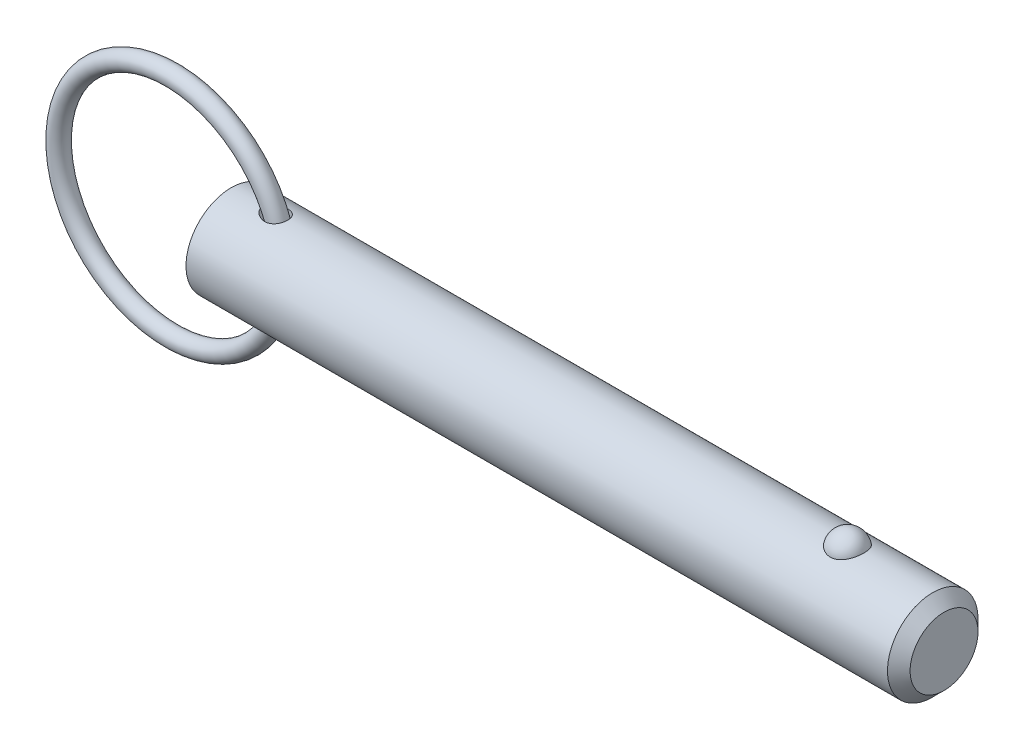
ISO-10303-21;
HEADER;
FILE_DESCRIPTION(('STEP AP214'),'2;1');
FILE_NAME('part.step','',(''),(''),'','','');
FILE_SCHEMA(('AUTOMOTIVE_DESIGN { 1 0 10303 214 1 1 1 1 }'));
ENDSEC;
DATA;
#1=APPLICATION_CONTEXT('core data for automotive mechanical design processes');
#2=APPLICATION_PROTOCOL_DEFINITION('international standard','automotive_design',2000,#1);
#3=PRODUCT_CONTEXT('',#1,'mechanical');
#4=PRODUCT('Part','Part','',(#3));
#5=PRODUCT_RELATED_PRODUCT_CATEGORY('part','',(#4));
#6=PRODUCT_DEFINITION_FORMATION('','',#4);
#7=PRODUCT_DEFINITION_CONTEXT('part definition',#1,'design');
#8=PRODUCT_DEFINITION('design','',#6,#7);
#9=PRODUCT_DEFINITION_SHAPE('','',#8);
#10=(LENGTH_UNIT() NAMED_UNIT(*) SI_UNIT(.MILLI.,.METRE.));
#11=(NAMED_UNIT(*) PLANE_ANGLE_UNIT() SI_UNIT($,.RADIAN.));
#12=(NAMED_UNIT(*) SI_UNIT($,.STERADIAN.) SOLID_ANGLE_UNIT());
#13=UNCERTAINTY_MEASURE_WITH_UNIT(LENGTH_MEASURE(1.E-05),#10,'distance_accuracy_value','');
#14=(GEOMETRIC_REPRESENTATION_CONTEXT(3) GLOBAL_UNCERTAINTY_ASSIGNED_CONTEXT((#13)) GLOBAL_UNIT_ASSIGNED_CONTEXT((#10,
#11,#12)) REPRESENTATION_CONTEXT('',''));
#15=CARTESIAN_POINT('',(0.,0.,0.));
#16=DIRECTION('',(0.,0.,1.));
#17=DIRECTION('',(1.,0.,0.));
#18=AXIS2_PLACEMENT_3D('',#15,#16,#17);
#19=CARTESIAN_POINT('',(-8.34703434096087,0.,0.));
#20=DIRECTION('',(0.,0.,1.));
#21=DIRECTION('',(1.,0.,0.));
#22=AXIS2_PLACEMENT_3D('',#19,#20,#21);
#23=TOROIDAL_SURFACE('',#22,15.875,1.27);
#24=CARTESIAN_POINT('',(8.79796565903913,0.,0.));
#25=VERTEX_POINT('',#24);
#26=VERTEX_LOOP('',#25);
#27=FACE_BOUND('',#26,.T.);
#28=ADVANCED_FACE('P0_F12',(#27),#23,.T.);
#29=CLOSED_SHELL('',(#28));
#30=MANIFOLD_SOLID_BREP('P0_B1',#29);
#31=CARTESIAN_POINT('',(0.,0.,0.));
#32=DIRECTION('',(1.,0.,0.));
#33=DIRECTION('',(0.,0.,-1.));
#34=AXIS2_PLACEMENT_3D('',#31,#32,#33);
#35=CYLINDRICAL_SURFACE('',#34,6.35);
#36=CARTESIAN_POINT('',(4.87230670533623,6.27273159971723,-0.987592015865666));
#37=CARTESIAN_POINT('',(4.94734735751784,6.26035058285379,-1.06623378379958));
#38=CARTESIAN_POINT('',(5.02968768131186,6.24755813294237,-1.13788608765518));
#39=CARTESIAN_POINT('',(5.2053426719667,6.22278258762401,-1.26640223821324));
#40=CARTESIAN_POINT('',(5.29867273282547,6.21080066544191,-1.32324497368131));
#41=CARTESIAN_POINT('',(5.49318962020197,6.18912414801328,-1.42117930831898));
#42=CARTESIAN_POINT('',(5.59435470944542,6.17942350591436,-1.46231273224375));
#43=CARTESIAN_POINT('',(5.80219659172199,6.16352555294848,-1.52793951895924));
#44=CARTESIAN_POINT('',(5.90887152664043,6.15732706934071,-1.55243845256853));
#45=CARTESIAN_POINT('',(6.12818220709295,6.14931784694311,-1.58387975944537));
#46=CARTESIAN_POINT('',(6.24090110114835,6.14763959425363,-1.59029227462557));
#47=CARTESIAN_POINT('',(6.46560233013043,6.14965588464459,-1.58248630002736));
#48=CARTESIAN_POINT('',(6.57758514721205,6.15334646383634,-1.56828303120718));
#49=CARTESIAN_POINT('',(6.78516594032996,6.1652116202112,-1.52091398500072));
#50=CARTESIAN_POINT('',(6.88126802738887,6.17288876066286,-1.48983713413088));
#51=CARTESIAN_POINT('',(7.06576629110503,6.19149190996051,-1.41052329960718));
#52=CARTESIAN_POINT('',(7.15416739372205,6.20241582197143,-1.36229738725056));
#53=CARTESIAN_POINT('',(7.31166929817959,6.2248616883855,-1.25548983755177));
#54=CARTESIAN_POINT('',(7.38181442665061,6.23621734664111,-1.19840625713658));
#55=CARTESIAN_POINT('',(7.51101296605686,6.259037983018,-1.07284763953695));
#56=CARTESIAN_POINT('',(7.57006844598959,6.2705029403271,-1.00437473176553));
#57=CARTESIAN_POINT('',(7.6737469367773,6.29184873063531,-0.860384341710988));
#58=CARTESIAN_POINT('',(7.71876694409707,6.30176816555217,-0.785157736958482));
#59=CARTESIAN_POINT('',(7.79574491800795,6.31935829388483,-0.628053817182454));
#60=CARTESIAN_POINT('',(7.82770308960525,6.32702902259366,-0.546176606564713));
#61=CARTESIAN_POINT('',(7.87788845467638,6.33930929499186,-0.377876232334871));
#62=CARTESIAN_POINT('',(7.89608106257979,6.34391112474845,-0.291442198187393));
#63=CARTESIAN_POINT('',(7.91820729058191,6.34953044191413,-0.116652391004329));
#64=CARTESIAN_POINT('',(7.9221404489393,6.35054781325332,-0.0282965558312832));
#65=CARTESIAN_POINT('',(7.91564686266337,6.34888556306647,0.148263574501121));
#66=CARTESIAN_POINT('',(7.90515337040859,6.34618875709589,0.236465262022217));
#67=CARTESIAN_POINT('',(7.8699153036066,6.33735741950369,0.409798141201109));
#68=CARTESIAN_POINT('',(7.84517062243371,6.33122286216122,0.494929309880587));
#69=CARTESIAN_POINT('',(7.7819985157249,6.31618517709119,0.659657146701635));
#70=CARTESIAN_POINT('',(7.74357645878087,6.30728313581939,0.739255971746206));
#71=CARTESIAN_POINT('',(7.65396632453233,6.28769050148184,0.890663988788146));
#72=CARTESIAN_POINT('',(7.60277911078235,6.27700002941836,0.962473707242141));
#73=CARTESIAN_POINT('',(7.48925881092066,6.2550822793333,1.09590260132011));
#74=CARTESIAN_POINT('',(7.42698604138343,6.24385813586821,1.15757361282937));
#75=CARTESIAN_POINT('',(7.29283556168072,6.2220655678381,1.26951234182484));
#76=CARTESIAN_POINT('',(7.2209588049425,6.21149707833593,1.31978118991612));
#77=CARTESIAN_POINT('',(7.06971853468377,6.19216002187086,1.40772509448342));
#78=CARTESIAN_POINT('',(6.99035873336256,6.18339056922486,1.44540635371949));
#79=CARTESIAN_POINT('',(6.82642723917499,6.16851603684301,1.50762653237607));
#80=CARTESIAN_POINT('',(6.7418548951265,6.16241129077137,1.53216380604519));
#81=CARTESIAN_POINT('',(6.56686412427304,6.15321474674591,1.56869994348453));
#82=CARTESIAN_POINT('',(6.47634467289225,6.15023369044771,1.58023897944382));
#83=CARTESIAN_POINT('',(6.29456956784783,6.14778331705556,1.58974172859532));
#84=CARTESIAN_POINT('',(6.20331368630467,6.1483151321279,1.58770106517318));
#85=CARTESIAN_POINT('',(6.01385969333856,6.15284811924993,1.5700487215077));
#86=CARTESIAN_POINT('',(5.91578322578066,6.15715979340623,1.55322212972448));
#87=CARTESIAN_POINT('',(5.72331909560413,6.16902415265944,1.5054032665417));
#88=CARTESIAN_POINT('',(5.6289344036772,6.17657939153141,1.4743998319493));
#89=CARTESIAN_POINT('',(5.4357260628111,6.19502494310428,1.39499475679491));
#90=CARTESIAN_POINT('',(5.33755891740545,6.20619097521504,1.34505268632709));
#91=CARTESIAN_POINT('',(5.15090047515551,6.23006191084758,1.22975103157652));
#92=CARTESIAN_POINT('',(5.06240741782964,6.24276653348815,1.16439425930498));
#93=CARTESIAN_POINT('',(4.91171642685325,6.26607433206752,1.03083814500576));
#94=CARTESIAN_POINT('',(4.84758224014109,6.27668356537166,0.964825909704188));
#95=CARTESIAN_POINT('',(4.73090054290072,6.29683133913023,0.823112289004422));
#96=CARTESIAN_POINT('',(4.67833688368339,6.30637136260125,0.747424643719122));
#97=CARTESIAN_POINT('',(4.59543145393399,6.32183254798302,0.601150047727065));
#98=CARTESIAN_POINT('',(4.56283099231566,6.32809321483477,0.531883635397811));
#99=CARTESIAN_POINT('',(4.50941370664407,6.33849198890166,0.388778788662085));
#100=CARTESIAN_POINT('',(4.48858876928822,6.34263155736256,0.314943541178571));
#101=CARTESIAN_POINT('',(4.46008864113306,6.3483236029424,0.164282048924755));
#102=CARTESIAN_POINT('',(4.45247558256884,6.34986385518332,0.08744340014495));
#103=CARTESIAN_POINT('',(4.45121096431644,6.35011863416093,-0.0663538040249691));
#104=CARTESIAN_POINT('',(4.45755802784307,6.34883343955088,-0.143312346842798));
#105=CARTESIAN_POINT('',(4.48267656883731,6.34380948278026,-0.288945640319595));
#106=CARTESIAN_POINT('',(4.50045680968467,6.34026665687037,-0.357802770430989));
#107=CARTESIAN_POINT('',(4.54636050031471,6.33128211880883,-0.491815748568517));
#108=CARTESIAN_POINT('',(4.57448566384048,6.32584009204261,-0.556970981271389));
#109=CARTESIAN_POINT('',(4.64209700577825,6.31308107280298,-0.687092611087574));
#110=CARTESIAN_POINT('',(4.68226903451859,6.30565525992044,-0.751689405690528));
#111=CARTESIAN_POINT('',(4.77120834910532,6.28979741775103,-0.874524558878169));
#112=CARTESIAN_POINT('',(4.81998302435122,6.28136452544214,-0.932757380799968));
#113=CARTESIAN_POINT('',(4.87230670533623,6.27273159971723,-0.987592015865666));
#114=B_SPLINE_CURVE_WITH_KNOTS('',3,(#36,#37,#38,#39,#40,#41,#42,#43,#44,#45,#46,#47,#48,#49,
#50,#51,#52,#53,#54,#55,#56,#57,#58,#59,#60,#61,#62,#63,#64,#65,#66,#67,#68,#69,#70,#71,#72,#73,
#74,#75,#76,#77,#78,#79,#80,#81,#82,#83,#84,#85,#86,#87,#88,#89,#90,#91,#92,#93,#94,#95,#96,#97,
#98,#99,#100,#101,#102,#103,#104,#105,#106,#107,#108,#109,#110,#111,#112,#113),.UNSPECIFIED.,
.T.,.F.,(4,2,2,2,2,2,2,2,2,2,2,2,2,2,2,2,2,2,2,2,2,2,2,2,2,2,2,2,2,2,2,2,2,2,2,2,2,2,4),(0.,
0.327902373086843,0.65626964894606,0.983756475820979,1.31113357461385,1.64800657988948,
1.98463099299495,2.28681225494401,2.58879878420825,2.86088594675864,3.13292229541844,
3.3963648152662,3.65980320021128,3.92390128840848,4.18800792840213,4.45334062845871,
4.7186753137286,4.98390596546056,5.24911867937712,5.51293017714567,5.7767155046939,
6.04037065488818,6.30405880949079,6.57680801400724,6.84964512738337,7.14724526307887,
7.44508014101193,7.77572668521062,8.10631295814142,8.38318772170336,8.65967357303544,
8.88915303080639,9.11847418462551,9.34887088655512,9.57924486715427,9.79193291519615,
10.0046562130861,10.2330958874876,10.4617327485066),.UNSPECIFIED.);
#115=CARTESIAN_POINT('',(4.87230670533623,6.27273159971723,-0.987592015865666));
#116=VERTEX_POINT('',#115);
#117=EDGE_CURVE('P1_E40',#116,#116,#114,.T.);
#118=ORIENTED_EDGE('',*,*,#117,.T.);
#119=EDGE_LOOP('',(#118));
#120=FACE_BOUND('',#119,.T.);
#121=CARTESIAN_POINT('',(98.4125,0.,0.));
#122=DIRECTION('',(1.,0.,0.));
#123=DIRECTION('',(0.,0.,-1.));
#124=AXIS2_PLACEMENT_3D('',#121,#122,#123);
#125=CIRCLE('',#124,6.35);
#126=CARTESIAN_POINT('',(98.4125,0.,-6.35));
#127=VERTEX_POINT('',#126);
#128=EDGE_CURVE('P1_E25',#127,#127,#125,.T.);
#129=ORIENTED_EDGE('',*,*,#128,.F.);
#130=EDGE_LOOP('',(#129));
#131=FACE_BOUND('',#130,.T.);
#132=CARTESIAN_POINT('',(0.,0.,0.));
#133=DIRECTION('',(1.,0.,0.));
#134=DIRECTION('',(0.,0.,-1.));
#135=AXIS2_PLACEMENT_3D('',#132,#133,#134);
#136=CIRCLE('',#135,6.35);
#137=CARTESIAN_POINT('',(0.,0.,-6.35));
#138=VERTEX_POINT('',#137);
#139=EDGE_CURVE('P1_E9',#138,#138,#136,.T.);
#140=ORIENTED_EDGE('',*,*,#139,.T.);
#141=EDGE_LOOP('',(#140));
#142=FACE_BOUND('',#141,.T.);
#143=CARTESIAN_POINT('',(86.4500214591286,5.87502187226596,2.40969251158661));
#144=CARTESIAN_POINT('',(86.3250305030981,5.87501645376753,2.40969773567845));
#145=CARTESIAN_POINT('',(86.2000806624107,5.87916061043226,2.39967292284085));
#146=CARTESIAN_POINT('',(85.9539091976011,5.8952311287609,2.35991730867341));
#147=CARTESIAN_POINT('',(85.8326863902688,5.90715499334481,2.33019283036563));
#148=CARTESIAN_POINT('',(85.5975170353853,5.93739567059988,2.252014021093));
#149=CARTESIAN_POINT('',(85.4835602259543,5.95570321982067,2.20358681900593));
#150=CARTESIAN_POINT('',(85.26557352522,5.9967206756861,2.089379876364));
#151=CARTESIAN_POINT('',(85.1615457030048,6.01943149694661,2.02359652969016));
#152=CARTESIAN_POINT('',(84.9629437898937,6.06760647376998,1.87428969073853));
#153=CARTESIAN_POINT('',(84.8687268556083,6.09313095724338,1.79031110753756));
#154=CARTESIAN_POINT('',(84.6952557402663,6.14375873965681,1.60800178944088));
#155=CARTESIAN_POINT('',(84.6160043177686,6.16886196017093,1.50966841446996));
#156=CARTESIAN_POINT('',(84.4708457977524,6.21724600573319,1.29645884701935));
#157=CARTESIAN_POINT('',(84.4056885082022,6.24039621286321,1.18104158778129));
#158=CARTESIAN_POINT('',(84.2947035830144,6.28117277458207,0.940351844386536));
#159=CARTESIAN_POINT('',(84.2488776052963,6.29879865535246,0.815078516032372));
#160=CARTESIAN_POINT('',(84.1770234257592,6.32692073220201,0.556494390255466));
#161=CARTESIAN_POINT('',(84.151249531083,6.33732517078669,0.423102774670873));
#162=CARTESIAN_POINT('',(84.1209885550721,6.34957673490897,0.153542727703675));
#163=CARTESIAN_POINT('',(84.1165009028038,6.35142408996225,0.0173743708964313));
#164=CARTESIAN_POINT('',(84.1288655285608,6.34638925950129,-0.253036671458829));
#165=CARTESIAN_POINT('',(84.1455949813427,6.33955731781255,-0.387285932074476));
#166=CARTESIAN_POINT('',(84.199843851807,6.31794129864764,-0.650851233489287));
#167=CARTESIAN_POINT('',(84.2373636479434,6.30315707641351,-0.780167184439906));
#168=CARTESIAN_POINT('',(84.332500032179,6.26711642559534,-1.03041949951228));
#169=CARTESIAN_POINT('',(84.390143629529,6.24585130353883,-1.15134433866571));
#170=CARTESIAN_POINT('',(84.5243522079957,6.19905619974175,-1.38129800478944));
#171=CARTESIAN_POINT('',(84.600918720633,6.17352587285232,-1.49032586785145));
#172=CARTESIAN_POINT('',(84.7717538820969,6.12080227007,-1.69393164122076));
#173=CARTESIAN_POINT('',(84.8661008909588,6.09360200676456,-1.78844209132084));
#174=CARTESIAN_POINT('',(85.0701196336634,6.04070434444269,-1.95970536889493));
#175=CARTESIAN_POINT('',(85.1797900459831,6.01500681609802,-2.03645972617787));
#176=CARTESIAN_POINT('',(85.4091876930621,5.96867714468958,-2.16845644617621));
#177=CARTESIAN_POINT('',(85.5286522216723,5.94794910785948,-2.22412062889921));
#178=CARTESIAN_POINT('',(85.7762188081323,5.91340580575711,-2.31440992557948));
#179=CARTESIAN_POINT('',(85.9043175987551,5.89958794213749,-2.34904294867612));
#180=CARTESIAN_POINT('',(86.158582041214,5.88111049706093,-2.39491590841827));
#181=CARTESIAN_POINT('',(86.2845207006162,5.87602512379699,-2.4072451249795));
#182=CARTESIAN_POINT('',(86.5367867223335,5.87428980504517,-2.41147867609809));
#183=CARTESIAN_POINT('',(86.663114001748,5.87763817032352,-2.40338710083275));
#184=CARTESIAN_POINT('',(86.9084170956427,5.89212921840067,-2.36762715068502));
#185=CARTESIAN_POINT('',(87.0274992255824,5.90302431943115,-2.34058030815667));
#186=CARTESIAN_POINT('',(87.2592447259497,5.93113752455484,-2.26839066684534));
#187=CARTESIAN_POINT('',(87.3719075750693,5.94835614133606,-2.22324640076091));
#188=CARTESIAN_POINT('',(87.5904009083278,5.98773016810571,-2.11493806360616));
#189=CARTESIAN_POINT('',(87.696028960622,6.00998499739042,-2.05140269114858));
#190=CARTESIAN_POINT('',(87.8953006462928,6.05690144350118,-1.90842705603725));
#191=CARTESIAN_POINT('',(87.9889415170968,6.08156361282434,-1.82898313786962));
#192=CARTESIAN_POINT('',(88.1666754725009,6.13211715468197,-1.65182429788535));
#193=CARTESIAN_POINT('',(88.2500559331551,6.15800825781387,-1.55339381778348));
#194=CARTESIAN_POINT('',(88.3997900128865,6.20712834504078,-1.34374214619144));
#195=CARTESIAN_POINT('',(88.4661405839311,6.23035685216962,-1.23251867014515));
#196=CARTESIAN_POINT('',(88.5823455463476,6.27251177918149,-0.996447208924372));
#197=CARTESIAN_POINT('',(88.6316072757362,6.29127762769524,-0.871278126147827));
#198=CARTESIAN_POINT('',(88.7096142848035,6.3215862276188,-0.613870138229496));
#199=CARTESIAN_POINT('',(88.738359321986,6.33312889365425,-0.481631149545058));
#200=CARTESIAN_POINT('',(88.7747705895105,6.34782349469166,-0.213672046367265));
#201=CARTESIAN_POINT('',(88.7824134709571,6.35096613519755,-0.077948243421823));
#202=CARTESIAN_POINT('',(88.7763951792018,6.34851322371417,0.192943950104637));
#203=CARTESIAN_POINT('',(88.7627343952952,6.3429178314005,0.328112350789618));
#204=CARTESIAN_POINT('',(88.7145036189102,6.32360512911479,0.593406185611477));
#205=CARTESIAN_POINT('',(88.6800313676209,6.30992579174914,0.723552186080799));
#206=CARTESIAN_POINT('',(88.5909539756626,6.27586325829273,0.975834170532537));
#207=CARTESIAN_POINT('',(88.5363476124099,6.25547965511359,1.09796966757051));
#208=CARTESIAN_POINT('',(88.4077587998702,6.20998183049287,1.33148921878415));
#209=CARTESIAN_POINT('',(88.3336742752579,6.18484288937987,1.44281227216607));
#210=CARTESIAN_POINT('',(88.1678204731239,6.13258735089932,1.65087683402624));
#211=CARTESIAN_POINT('',(88.0760515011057,6.10547078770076,1.74761859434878));
#212=CARTESIAN_POINT('',(87.8771839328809,6.0523587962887,1.92350926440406));
#213=CARTESIAN_POINT('',(87.770133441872,6.0263601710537,2.00271146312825));
#214=CARTESIAN_POINT('',(87.5431384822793,5.97843747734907,2.14154159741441));
#215=CARTESIAN_POINT('',(87.423191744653,5.95651412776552,2.20116608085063));
#216=CARTESIAN_POINT('',(87.1645236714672,5.91812106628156,2.30250570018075));
#217=CARTESIAN_POINT('',(87.0250698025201,5.90217533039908,2.342567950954));
#218=CARTESIAN_POINT('',(86.7403974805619,5.88063128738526,2.39615214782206));
#219=CARTESIAN_POINT('',(86.5951817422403,5.8750281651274,2.40968644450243));
#220=CARTESIAN_POINT('',(86.4500214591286,5.87502187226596,2.40969251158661));
#221=B_SPLINE_CURVE_WITH_KNOTS('',3,(#143,#144,#145,#146,#147,#148,#149,#150,#151,#152,#153,
#154,#155,#156,#157,#158,#159,#160,#161,#162,#163,#164,#165,#166,#167,#168,#169,#170,#171,#172,
#173,#174,#175,#176,#177,#178,#179,#180,#181,#182,#183,#184,#185,#186,#187,#188,#189,#190,#191,
#192,#193,#194,#195,#196,#197,#198,#199,#200,#201,#202,#203,#204,#205,#206,#207,#208,#209,#210,
#211,#212,#213,#214,#215,#216,#217,#218,#219,#220),.UNSPECIFIED.,.T.,.F.,(4,2,2,2,2,2,2,2,2,2,2,
2,2,2,2,2,2,2,2,2,2,2,2,2,2,2,2,2,2,2,2,2,2,2,2,2,2,2,4),(0.,0.374440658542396,
0.748761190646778,1.12254078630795,1.49639810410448,1.88098871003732,2.26565013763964,
2.66741104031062,3.06920639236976,3.47601794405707,3.88281858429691,4.28727498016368,
4.69173873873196,5.09674745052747,5.50178895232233,5.90865911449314,6.31549420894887,
6.7136985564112,7.11175305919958,7.4897807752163,7.86773278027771,8.23383886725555,
8.59997464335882,8.974090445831,9.34829231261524,9.74122667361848,10.1342313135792,
10.5397522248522,10.9452779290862,11.3512521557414,11.7572189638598,12.1612938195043,
12.5653932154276,12.9716540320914,13.3779078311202,13.7829098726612,14.1879832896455,
14.6230486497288,15.057911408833),.UNSPECIFIED.);
#222=CARTESIAN_POINT('',(86.4500214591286,5.87502187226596,2.40969251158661));
#223=VERTEX_POINT('',#222);
#224=EDGE_CURVE('P1_E34',#223,#223,#221,.T.);
#225=ORIENTED_EDGE('',*,*,#224,.T.);
#226=EDGE_LOOP('',(#225));
#227=FACE_BOUND('',#226,.T.);
#228=CARTESIAN_POINT('',(4.87230670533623,-6.27273159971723,-0.987592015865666));
#229=CARTESIAN_POINT('',(4.81440819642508,-6.28228431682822,-0.926913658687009));
#230=CARTESIAN_POINT('',(4.76085022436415,-6.29159289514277,-0.862071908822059));
#231=CARTESIAN_POINT('',(4.66448472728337,-6.3088950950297,-0.72465504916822));
#232=CARTESIAN_POINT('',(4.62166818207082,-6.31688981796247,-0.652086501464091));
#233=CARTESIAN_POINT('',(4.54882773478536,-6.33076917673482,-0.49974775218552));
#234=CARTESIAN_POINT('',(4.51891553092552,-6.33663532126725,-0.419921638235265));
#235=CARTESIAN_POINT('',(4.47476924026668,-6.3453711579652,-0.255882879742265));
#236=CARTESIAN_POINT('',(4.46051880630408,-6.34824397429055,-0.171674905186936));
#237=CARTESIAN_POINT('',(4.44966179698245,-6.35043041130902,-0.0120763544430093));
#238=CARTESIAN_POINT('',(4.45117530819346,-6.35012328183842,0.0631849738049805));
#239=CARTESIAN_POINT('',(4.46726452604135,-6.34689000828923,0.212230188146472));
#240=CARTESIAN_POINT('',(4.48184026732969,-6.3439638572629,0.286014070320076));
#241=CARTESIAN_POINT('',(4.52202068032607,-6.33603071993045,0.426550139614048));
#242=CARTESIAN_POINT('',(4.54707079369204,-6.33112875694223,0.493469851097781));
#243=CARTESIAN_POINT('',(4.6066985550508,-6.31972370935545,0.622743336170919));
#244=CARTESIAN_POINT('',(4.64127887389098,-6.31322017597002,0.685095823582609));
#245=CARTESIAN_POINT('',(4.72328142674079,-6.29826068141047,0.811769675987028));
#246=CARTESIAN_POINT('',(4.77176118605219,-6.28966287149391,0.875386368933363));
#247=CARTESIAN_POINT('',(4.87703902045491,-6.27182325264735,0.99519278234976));
#248=CARTESIAN_POINT('',(4.93384225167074,-6.26258104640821,1.05137785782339));
#249=CARTESIAN_POINT('',(5.06617436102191,-6.24228878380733,1.16635591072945));
#250=CARTESIAN_POINT('',(5.14318167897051,-6.23124423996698,1.22345054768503));
#251=CARTESIAN_POINT('',(5.30475767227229,-6.21023402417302,1.32598441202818));
#252=CARTESIAN_POINT('',(5.38933237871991,-6.20026922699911,1.37141422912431));
#253=CARTESIAN_POINT('',(5.5776013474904,-6.18099350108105,1.45601817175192));
#254=CARTESIAN_POINT('',(5.68224348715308,-6.17201456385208,1.4931788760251));
#255=CARTESIAN_POINT('',(5.89649087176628,-6.15800474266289,1.5499484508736));
#256=CARTESIAN_POINT('',(6.0060970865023,-6.15297463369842,1.56955387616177));
#257=CARTESIAN_POINT('',(6.22752772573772,-6.14779725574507,1.58971993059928));
#258=CARTESIAN_POINT('',(6.33935715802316,-6.14766266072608,1.59023112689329));
#259=CARTESIAN_POINT('',(6.56108231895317,-6.15269227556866,1.57066564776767));
#260=CARTESIAN_POINT('',(6.67097982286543,-6.15785133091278,1.55060899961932));
#261=CARTESIAN_POINT('',(6.87257705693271,-6.17211580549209,1.4927326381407));
#262=CARTESIAN_POINT('',(6.96494608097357,-6.18072242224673,1.45711948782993));
#263=CARTESIAN_POINT('',(7.14129343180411,-6.20069920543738,1.36960980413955));
#264=CARTESIAN_POINT('',(7.22527609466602,-6.21206793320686,1.31772174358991));
#265=CARTESIAN_POINT('',(7.37471505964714,-6.23497047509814,1.20443359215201));
#266=CARTESIAN_POINT('',(7.44115811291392,-6.24639757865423,1.14430788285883));
#267=CARTESIAN_POINT('',(7.56261868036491,-6.26896339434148,1.0134084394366));
#268=CARTESIAN_POINT('',(7.61763801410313,-6.28010215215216,0.942636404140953));
#269=CARTESIAN_POINT('',(7.71360563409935,-6.30055923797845,0.794304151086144));
#270=CARTESIAN_POINT('',(7.75485562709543,-6.3099143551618,0.716943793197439));
#271=CARTESIAN_POINT('',(7.82406051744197,-6.32610528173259,0.556244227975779));
#272=CARTESIAN_POINT('',(7.85201540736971,-6.33294108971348,0.472905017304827));
#273=CARTESIAN_POINT('',(7.89408663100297,-6.34338077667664,0.302249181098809));
#274=CARTESIAN_POINT('',(7.90814615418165,-6.34697138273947,0.214917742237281));
#275=CARTESIAN_POINT('',(7.92192329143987,-6.35048887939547,0.0390564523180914));
#276=CARTESIAN_POINT('',(7.92164046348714,-6.3504156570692,-0.0494734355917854));
#277=CARTESIAN_POINT('',(7.90670754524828,-6.34660520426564,-0.225592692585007));
#278=CARTESIAN_POINT('',(7.89199989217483,-6.34285329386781,-0.31317687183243));
#279=CARTESIAN_POINT('',(7.8484534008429,-6.33206809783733,-0.484549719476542));
#280=CARTESIAN_POINT('',(7.81961455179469,-6.32503480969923,-0.568338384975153));
#281=CARTESIAN_POINT('',(7.74850591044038,-6.30846389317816,-0.729625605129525));
#282=CARTESIAN_POINT('',(7.70625193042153,-6.29892921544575,-0.807131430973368));
#283=CARTESIAN_POINT('',(7.60933437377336,-6.27840608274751,-0.953731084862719));
#284=CARTESIAN_POINT('',(7.55467181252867,-6.2674177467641,-1.02282560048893));
#285=CARTESIAN_POINT('',(7.43471786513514,-6.24527869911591,-1.15028913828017));
#286=CARTESIAN_POINT('',(7.36948829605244,-6.23412925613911,-1.20871657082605));
#287=CARTESIAN_POINT('',(7.2300172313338,-6.21283678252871,-1.3137894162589));
#288=CARTESIAN_POINT('',(7.15577649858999,-6.20269366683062,-1.36043582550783));
#289=CARTESIAN_POINT('',(7.00025986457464,-6.18446636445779,-1.4410399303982));
#290=CARTESIAN_POINT('',(6.91896776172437,-6.17638709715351,-1.47496739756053));
#291=CARTESIAN_POINT('',(6.75184232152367,-6.16309237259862,-1.52957024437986));
#292=CARTESIAN_POINT('',(6.66600814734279,-6.15787744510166,-1.55024317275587));
#293=CARTESIAN_POINT('',(6.48842585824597,-6.15055064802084,-1.57906962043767));
#294=CARTESIAN_POINT('',(6.39658108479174,-6.14857915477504,-1.58665744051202));
#295=CARTESIAN_POINT('',(6.21279832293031,-6.14817707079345,-1.58821048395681));
#296=CARTESIAN_POINT('',(6.12086031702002,-6.14974736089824,-1.58217231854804));
#297=CARTESIAN_POINT('',(5.92996902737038,-6.15640095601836,-1.55609403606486));
#298=CARTESIAN_POINT('',(5.83120653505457,-6.16181208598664,-1.53474519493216));
#299=CARTESIAN_POINT('',(5.63804881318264,-6.17573474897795,-1.47771859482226));
#300=CARTESIAN_POINT('',(5.54365953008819,-6.18425037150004,-1.44202192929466));
#301=CARTESIAN_POINT('',(5.34413923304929,-6.20522938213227,-1.34918979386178));
#302=CARTESIAN_POINT('',(5.24033140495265,-6.21813417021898,-1.28928337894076));
#303=CARTESIAN_POINT('',(5.04554233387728,-6.24510162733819,-1.15156760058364));
#304=CARTESIAN_POINT('',(4.9545459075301,-6.25916289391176,-1.07377972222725));
#305=CARTESIAN_POINT('',(4.87230670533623,-6.27273159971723,-0.987592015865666));
#306=B_SPLINE_CURVE_WITH_KNOTS('',3,(#228,#229,#230,#231,#232,#233,#234,#235,#236,#237,#238,
#239,#240,#241,#242,#243,#244,#245,#246,#247,#248,#249,#250,#251,#252,#253,#254,#255,#256,#257,
#258,#259,#260,#261,#262,#263,#264,#265,#266,#267,#268,#269,#270,#271,#272,#273,#274,#275,#276,
#277,#278,#279,#280,#281,#282,#283,#284,#285,#286,#287,#288,#289,#290,#291,#292,#293,#294,#295,
#296,#297,#298,#299,#300,#301,#302,#303,#304,#305),.UNSPECIFIED.,.T.,.F.,(4,2,2,2,2,2,2,2,2,2,2,
2,2,2,2,2,2,2,2,2,2,2,2,2,2,2,2,2,2,2,2,2,2,2,2,2,2,2,4),(0.,0.252951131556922,
0.505689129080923,0.760572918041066,1.01519041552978,1.23982791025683,1.46446600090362,
1.67847364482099,1.89254132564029,2.13299551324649,2.37359928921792,2.6619896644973,
2.95061196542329,3.28329078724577,3.61603488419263,3.9496403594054,4.28292130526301,
4.57939201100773,4.87570862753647,5.14538810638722,5.41502459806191,5.67829123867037,
5.94155802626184,6.20589676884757,6.47024365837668,6.73564974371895,7.00105603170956,
7.26615064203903,7.53122356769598,7.79479837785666,8.05835088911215,8.32252586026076,
8.58674967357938,8.86213419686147,9.137587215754,9.43991696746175,9.74264642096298,
10.1023688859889,10.461661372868),.UNSPECIFIED.);
#307=CARTESIAN_POINT('',(4.87230670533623,-6.27273159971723,-0.987592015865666));
#308=VERTEX_POINT('',#307);
#309=EDGE_CURVE('P1_E17',#308,#308,#306,.T.);
#310=ORIENTED_EDGE('',*,*,#309,.T.);
#311=EDGE_LOOP('',(#310));
#312=FACE_BOUND('',#311,.T.);
#313=ADVANCED_FACE('P1_F13',(#120,#131,#142,#227,#312),#35,.T.);
#314=CARTESIAN_POINT('',(0.,0.,0.));
#315=DIRECTION('',(-1.,0.,0.));
#316=DIRECTION('',(0.,0.,1.));
#317=AXIS2_PLACEMENT_3D('',#314,#315,#316);
#318=PLANE('',#317);
#319=ORIENTED_EDGE('',*,*,#139,.F.);
#320=EDGE_LOOP('',(#319));
#321=FACE_BOUND('',#320,.T.);
#322=ADVANCED_FACE('P1_F15',(#321),#318,.T.);
#323=CARTESIAN_POINT('',(100.,0.,0.));
#324=DIRECTION('',(-1.,0.,0.));
#325=DIRECTION('',(0.,0.,1.));
#326=AXIS2_PLACEMENT_3D('',#323,#324,#325);
#327=CONICAL_SURFACE('',#326,4.76250000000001,0.785398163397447);
#328=ORIENTED_EDGE('',*,*,#128,.T.);
#329=EDGE_LOOP('',(#328));
#330=FACE_BOUND('',#329,.T.);
#331=CARTESIAN_POINT('',(100.,0.,0.));
#332=DIRECTION('',(1.,0.,0.));
#333=DIRECTION('',(0.,0.,-1.));
#334=AXIS2_PLACEMENT_3D('',#331,#332,#333);
#335=CIRCLE('',#334,4.76250000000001);
#336=CARTESIAN_POINT('',(100.,0.,-4.76250000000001));
#337=VERTEX_POINT('',#336);
#338=EDGE_CURVE('P1_E30',#337,#337,#335,.T.);
#339=ORIENTED_EDGE('',*,*,#338,.F.);
#340=EDGE_LOOP('',(#339));
#341=FACE_BOUND('',#340,.T.);
#342=ADVANCED_FACE('P1_F55',(#330,#341),#327,.T.);
#343=CARTESIAN_POINT('',(100.,4.76250000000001,0.));
#344=DIRECTION('',(1.,0.,0.));
#345=DIRECTION('',(0.,0.,-1.));
#346=AXIS2_PLACEMENT_3D('',#343,#344,#345);
#347=PLANE('',#346);
#348=ORIENTED_EDGE('',*,*,#338,.T.);
#349=EDGE_LOOP('',(#348));
#350=FACE_BOUND('',#349,.T.);
#351=ADVANCED_FACE('P1_F51',(#350),#347,.T.);
#352=CARTESIAN_POINT('',(86.4500214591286,5.715,0.));
#353=DIRECTION('',(-1.,0.,0.));
#354=DIRECTION('',(0.,1.,0.));
#355=AXIS2_PLACEMENT_3D('',#352,#353,#354);
#356=SPHERICAL_SURFACE('',#355,2.41500000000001);
#357=ORIENTED_EDGE('',*,*,#224,.F.);
#358=EDGE_LOOP('',(#357));
#359=FACE_BOUND('',#358,.T.);
#360=ADVANCED_FACE('P1_F46',(#359),#356,.T.);
#361=CARTESIAN_POINT('',(-8.34703434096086,0.,0.));
#362=DIRECTION('',(0.,0.,1.));
#363=DIRECTION('',(1.,0.,0.));
#364=AXIS2_PLACEMENT_3D('',#361,#362,#363);
#365=TOROIDAL_SURFACE('',#364,15.875,1.5875);
#366=ORIENTED_EDGE('',*,*,#309,.F.);
#367=EDGE_LOOP('',(#366));
#368=FACE_BOUND('',#367,.T.);
#369=ORIENTED_EDGE('',*,*,#117,.F.);
#370=EDGE_LOOP('',(#369));
#371=FACE_BOUND('',#370,.T.);
#372=ADVANCED_FACE('P1_F50',(#368,#371),#365,.F.);
#373=CLOSED_SHELL('',(#313,#322,#342,#351,#360,#372));
#374=MANIFOLD_SOLID_BREP('P1_B1',#373);
#375=ADVANCED_BREP_SHAPE_REPRESENTATION('',(#18,#30,#374),#14);
#376=SHAPE_DEFINITION_REPRESENTATION(#9,#375);
ENDSEC;
END-ISO-10303-21;
